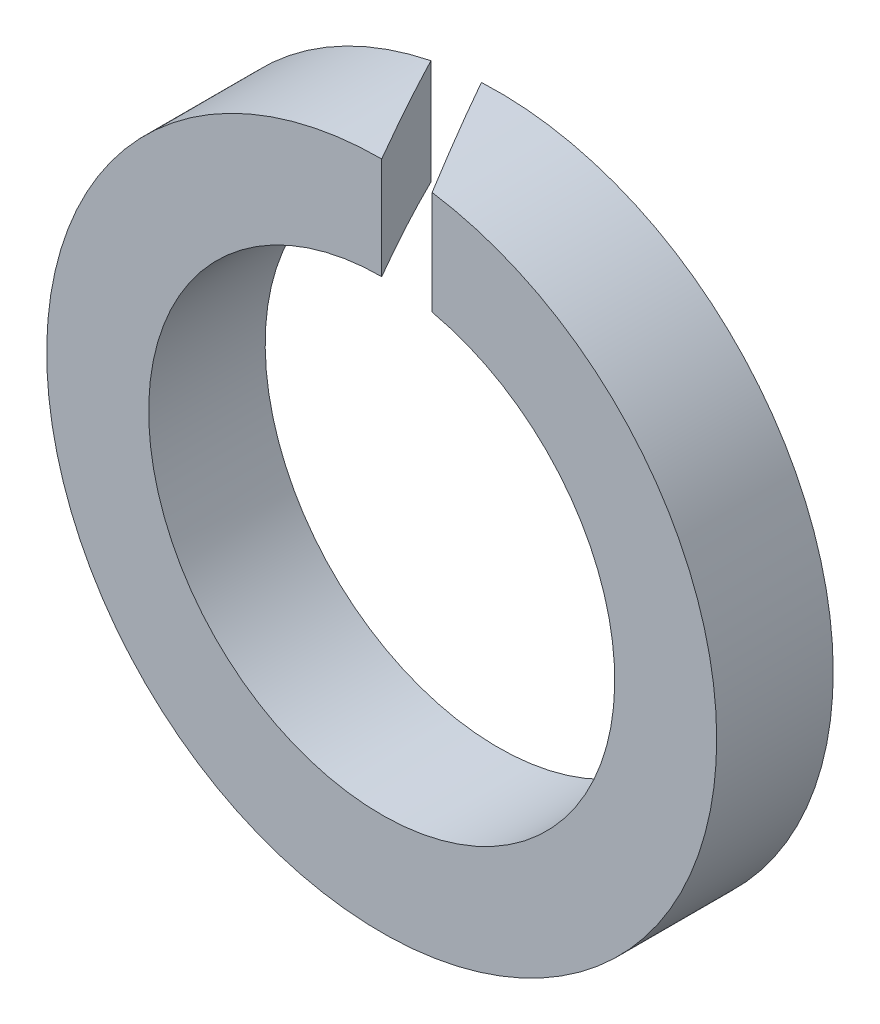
ISO-10303-21;
HEADER;
FILE_DESCRIPTION(('STEP AP214'),'2;1');
FILE_NAME('part.step','',(''),(''),'','','');
FILE_SCHEMA(('AUTOMOTIVE_DESIGN { 1 0 10303 214 1 1 1 1 }'));
ENDSEC;
DATA;
#1=APPLICATION_CONTEXT('core data for automotive mechanical design processes');
#2=APPLICATION_PROTOCOL_DEFINITION('international standard','automotive_design',2000,#1);
#3=PRODUCT_CONTEXT('',#1,'mechanical');
#4=PRODUCT('Part','Part','',(#3));
#5=PRODUCT_RELATED_PRODUCT_CATEGORY('part','',(#4));
#6=PRODUCT_DEFINITION_FORMATION('','',#4);
#7=PRODUCT_DEFINITION_CONTEXT('part definition',#1,'design');
#8=PRODUCT_DEFINITION('design','',#6,#7);
#9=PRODUCT_DEFINITION_SHAPE('','',#8);
#10=(LENGTH_UNIT() NAMED_UNIT(*) SI_UNIT(.MILLI.,.METRE.));
#11=(NAMED_UNIT(*) PLANE_ANGLE_UNIT() SI_UNIT($,.RADIAN.));
#12=(NAMED_UNIT(*) SI_UNIT($,.STERADIAN.) SOLID_ANGLE_UNIT());
#13=UNCERTAINTY_MEASURE_WITH_UNIT(LENGTH_MEASURE(1.E-05),#10,'distance_accuracy_value','');
#14=(GEOMETRIC_REPRESENTATION_CONTEXT(3) GLOBAL_UNCERTAINTY_ASSIGNED_CONTEXT((#13)) GLOBAL_UNIT_ASSIGNED_CONTEXT((#10,
#11,#12)) REPRESENTATION_CONTEXT('',''));
#15=CARTESIAN_POINT('',(0.,0.,0.));
#16=DIRECTION('',(0.,0.,1.));
#17=DIRECTION('',(1.,0.,0.));
#18=AXIS2_PLACEMENT_3D('',#15,#16,#17);
#19=CARTESIAN_POINT('',(0.,0.,-4.));
#20=DIRECTION('',(0.,0.,1.));
#21=DIRECTION('',(1.,0.,0.));
#22=AXIS2_PLACEMENT_3D('',#19,#20,#21);
#23=CYLINDRICAL_SURFACE('',#22,11.5);
#24=CARTESIAN_POINT('',(0.,0.,-2.99999999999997));
#25=DIRECTION('',(0.866025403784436,0.,-0.500000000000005));
#26=DIRECTION('',(0.500000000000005,0.,0.866025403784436));
#27=AXIS2_PLACEMENT_3D('',#24,#25,#26);
#28=ELLIPSE('',#27,22.9999999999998,11.5);
#29=CARTESIAN_POINT('',(1.7320508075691,11.3688170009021,0.));
#30=VERTEX_POINT('',#29);
#31=CARTESIAN_POINT('',(-0.577350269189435,11.48549810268,-4.));
#32=VERTEX_POINT('',#31);
#33=EDGE_CURVE('E98',#30,#32,#28,.F.);
#34=ORIENTED_EDGE('',*,*,#33,.F.);
#35=CARTESIAN_POINT('',(0.,0.,0.));
#36=DIRECTION('',(0.,0.,1.));
#37=DIRECTION('',(1.,0.,0.));
#38=AXIS2_PLACEMENT_3D('',#35,#36,#37);
#39=CIRCLE('',#38,11.5);
#40=CARTESIAN_POINT('',(2.1163626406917E-13,11.5,0.));
#41=VERTEX_POINT('',#40);
#42=EDGE_CURVE('E93',#41,#30,#39,.T.);
#43=ORIENTED_EDGE('',*,*,#42,.F.);
#44=CARTESIAN_POINT('',(0.,0.,0.));
#45=DIRECTION('',(-0.866025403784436,0.,0.500000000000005));
#46=DIRECTION('',(0.500000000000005,0.,0.866025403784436));
#47=AXIS2_PLACEMENT_3D('',#44,#45,#46);
#48=ELLIPSE('',#47,22.9999999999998,11.5);
#49=CARTESIAN_POINT('',(-2.30940107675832,11.2657297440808,-4.));
#50=VERTEX_POINT('',#49);
#51=EDGE_CURVE('E78',#50,#41,#48,.F.);
#52=ORIENTED_EDGE('',*,*,#51,.F.);
#53=CARTESIAN_POINT('',(0.,0.,-4.));
#54=DIRECTION('',(0.,0.,1.));
#55=DIRECTION('',(1.,0.,0.));
#56=AXIS2_PLACEMENT_3D('',#53,#54,#55);
#57=CIRCLE('',#56,11.5);
#58=EDGE_CURVE('E99',#50,#32,#57,.T.);
#59=ORIENTED_EDGE('',*,*,#58,.T.);
#60=EDGE_LOOP('',(#34,#43,#52,#59));
#61=FACE_BOUND('',#60,.T.);
#62=ADVANCED_FACE('F41',(#61),#23,.T.);
#63=CARTESIAN_POINT('',(0.,0.,-4.));
#64=DIRECTION('',(0.,0.,1.));
#65=DIRECTION('',(1.,0.,0.));
#66=AXIS2_PLACEMENT_3D('',#63,#64,#65);
#67=PLANE('',#66);
#68=ORIENTED_EDGE('',*,*,#58,.F.);
#69=DIRECTION('',(0.,-1.,0.));
#70=VECTOR('',#69,1.);
#71=CARTESIAN_POINT('',(-2.30940107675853,-1.31838984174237E-13,-4.));
#72=LINE('',#71,#70);
#73=CARTESIAN_POINT('',(-2.30940107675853,7.6594168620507,-4.));
#74=VERTEX_POINT('',#73);
#75=EDGE_CURVE('E81',#50,#74,#72,.T.);
#76=ORIENTED_EDGE('',*,*,#75,.T.);
#77=CARTESIAN_POINT('',(0.,0.,-4.));
#78=DIRECTION('',(0.,0.,1.));
#79=DIRECTION('',(1.,0.,0.));
#80=AXIS2_PLACEMENT_3D('',#77,#78,#79);
#81=CIRCLE('',#80,8.);
#82=CARTESIAN_POINT('',(-0.577350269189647,7.97913946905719,-4.));
#83=VERTEX_POINT('',#82);
#84=EDGE_CURVE('E100',#74,#83,#81,.T.);
#85=ORIENTED_EDGE('',*,*,#84,.T.);
#86=DIRECTION('',(0.,1.,0.));
#87=VECTOR('',#86,1.);
#88=CARTESIAN_POINT('',(-0.577350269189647,0.,-4.));
#89=LINE('',#88,#87);
#90=EDGE_CURVE('E55',#83,#32,#89,.T.);
#91=ORIENTED_EDGE('',*,*,#90,.T.);
#92=EDGE_LOOP('',(#68,#76,#85,#91));
#93=FACE_BOUND('',#92,.T.);
#94=ADVANCED_FACE('F110',(#93),#67,.F.);
#95=CARTESIAN_POINT('',(0.,0.,0.));
#96=DIRECTION('',(0.,0.,1.));
#97=DIRECTION('',(1.,0.,0.));
#98=AXIS2_PLACEMENT_3D('',#95,#96,#97);
#99=PLANE('',#98);
#100=DIRECTION('',(0.,1.,0.));
#101=VECTOR('',#100,1.);
#102=CARTESIAN_POINT('',(0.,1.5,0.));
#103=LINE('',#102,#101);
#104=CARTESIAN_POINT('',(0.,7.99999999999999,0.));
#105=VERTEX_POINT('',#104);
#106=EDGE_CURVE('E63',#105,#41,#103,.T.);
#107=ORIENTED_EDGE('',*,*,#106,.T.);
#108=ORIENTED_EDGE('',*,*,#42,.T.);
#109=DIRECTION('',(0.,1.,0.));
#110=VECTOR('',#109,1.);
#111=CARTESIAN_POINT('',(1.73205080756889,1.50000000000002,0.));
#112=LINE('',#111,#110);
#113=CARTESIAN_POINT('',(1.73205080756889,7.8102496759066,0.));
#114=VERTEX_POINT('',#113);
#115=EDGE_CURVE('E95',#114,#30,#112,.T.);
#116=ORIENTED_EDGE('',*,*,#115,.F.);
#117=CARTESIAN_POINT('',(0.,0.,0.));
#118=DIRECTION('',(0.,0.,1.));
#119=DIRECTION('',(1.,0.,0.));
#120=AXIS2_PLACEMENT_3D('',#117,#118,#119);
#121=CIRCLE('',#120,8.);
#122=EDGE_CURVE('E86',#105,#114,#121,.T.);
#123=ORIENTED_EDGE('',*,*,#122,.F.);
#124=EDGE_LOOP('',(#107,#108,#116,#123));
#125=FACE_BOUND('',#124,.T.);
#126=ADVANCED_FACE('F91',(#125),#99,.T.);
#127=CARTESIAN_POINT('',(0.,0.,-6.));
#128=DIRECTION('',(0.,0.,1.));
#129=DIRECTION('',(1.,0.,0.));
#130=AXIS2_PLACEMENT_3D('',#127,#128,#129);
#131=CYLINDRICAL_SURFACE('',#130,8.);
#132=ORIENTED_EDGE('',*,*,#84,.F.);
#133=CARTESIAN_POINT('',(0.,0.,0.));
#134=DIRECTION('',(-0.866025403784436,0.,0.500000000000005));
#135=DIRECTION('',(0.500000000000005,0.,0.866025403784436));
#136=AXIS2_PLACEMENT_3D('',#133,#134,#135);
#137=ELLIPSE('',#136,15.9999999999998,8.);
#138=EDGE_CURVE('E13',#74,#105,#137,.F.);
#139=ORIENTED_EDGE('',*,*,#138,.T.);
#140=ORIENTED_EDGE('',*,*,#122,.T.);
#141=CARTESIAN_POINT('',(0.,0.,-2.99999999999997));
#142=DIRECTION('',(0.866025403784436,0.,-0.500000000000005));
#143=DIRECTION('',(0.500000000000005,0.,0.866025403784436));
#144=AXIS2_PLACEMENT_3D('',#141,#142,#143);
#145=ELLIPSE('',#144,15.9999999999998,8.);
#146=EDGE_CURVE('E48',#114,#83,#145,.F.);
#147=ORIENTED_EDGE('',*,*,#146,.T.);
#148=EDGE_LOOP('',(#132,#139,#140,#147));
#149=FACE_BOUND('',#148,.T.);
#150=ADVANCED_FACE('F108',(#149),#131,.F.);
#151=CARTESIAN_POINT('',(1.73205080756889,1.50000000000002,0.));
#152=DIRECTION('',(0.866025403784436,0.,-0.500000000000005));
#153=DIRECTION('',(-0.500000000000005,0.,-0.866025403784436));
#154=AXIS2_PLACEMENT_3D('',#151,#152,#153);
#155=PLANE('',#154);
#156=ORIENTED_EDGE('',*,*,#33,.T.);
#157=ORIENTED_EDGE('',*,*,#90,.F.);
#158=ORIENTED_EDGE('',*,*,#146,.F.);
#159=ORIENTED_EDGE('',*,*,#115,.T.);
#160=EDGE_LOOP('',(#156,#157,#158,#159));
#161=FACE_BOUND('',#160,.T.);
#162=ADVANCED_FACE('F115',(#161),#155,.F.);
#163=CARTESIAN_POINT('',(0.,1.5,0.));
#164=DIRECTION('',(-0.866025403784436,0.,0.500000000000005));
#165=DIRECTION('',(0.500000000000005,0.,0.866025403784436));
#166=AXIS2_PLACEMENT_3D('',#163,#164,#165);
#167=PLANE('',#166);
#168=ORIENTED_EDGE('',*,*,#51,.T.);
#169=ORIENTED_EDGE('',*,*,#106,.F.);
#170=ORIENTED_EDGE('',*,*,#138,.F.);
#171=ORIENTED_EDGE('',*,*,#75,.F.);
#172=EDGE_LOOP('',(#168,#169,#170,#171));
#173=FACE_BOUND('',#172,.T.);
#174=ADVANCED_FACE('F79',(#173),#167,.F.);
#175=CLOSED_SHELL('',(#62,#94,#126,#150,#162,#174));
#176=MANIFOLD_SOLID_BREP('B2',#175);
#177=ADVANCED_BREP_SHAPE_REPRESENTATION('',(#18,#176),#14);
#178=SHAPE_DEFINITION_REPRESENTATION(#9,#177);
ENDSEC;
END-ISO-10303-21;
